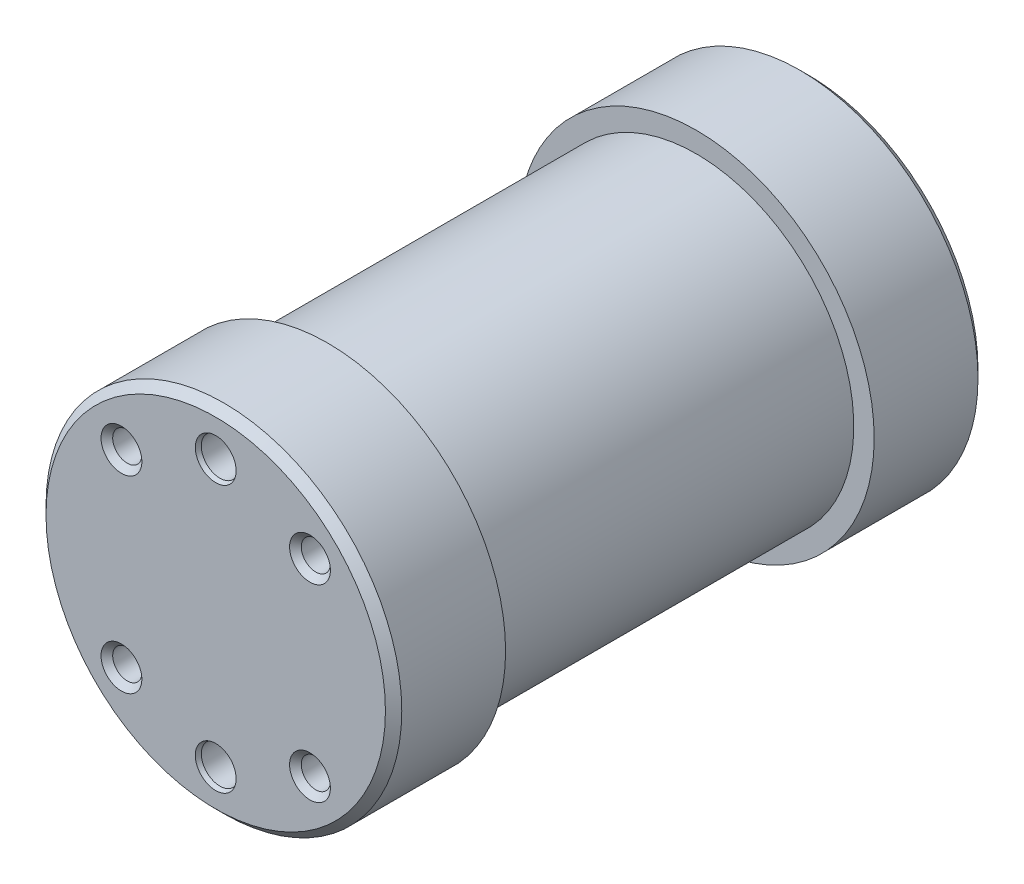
from build123d import *

# Parameters (mm, degrees)
CHAMFER1_SIZE     = 0.7
CIRPATTERN1_COUNT = 4


with BuildPart() as part:
    # Sketch2 → Revolve1 (revolve)
    with BuildSketch(Plane(origin=(0, 0, 0), x_dir=(1, 0, 0), z_dir=(0, 1, 0)), mode=Mode.PRIVATE) as revolve1_sk:
        Polygon((0, 25.4), (0, -25.4), (15.25, -25.4), (15.25, -15.8), (13.5, -15.8), (13.5, 15.8), (15.25, 15.8), (15.25, 25.4), align=None)
    revolve(revolve1_sk.sketch.rotate(Axis((0, 0, -25.4), (0, 0, 1)), 180), axis=Axis((0, 0, -25.4), (0, 0, 1)))

    # Chamfer1
    chamfer1_edges = [part.edges().sort_by_distance(p)[0] for p in [
        (15.25, 0, -25.4),
        (15.25, 0, 25.4),
    ]]
    chamfer(chamfer1_edges, length=CHAMFER1_SIZE)

    # Sketch3 → M3x0.5 Tapped Hole1 (revolve, cut)
    with BuildSketch(Plane(origin=(-8.082230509, -8.082230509, 25.4), x_dir=(0, -1, 0), z_dir=(1, 0, 0))):
        Polygon((0, 0), (0, 8.751075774), (1.25, 8), (1.25, 0.5), (1.75, 0), align=None)
    m3x0_5_tapped_hole1 = revolve(axis=Axis((-8.082230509, -8.082230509, 31.75), (0, 0, -1)), mode=Mode.SUBTRACT)

    # CirPattern1: M3x0.5 Tapped Hole1 ×4 about axis
    cirpattern1_axis = Axis((0, 0, 0), (0, 0, 1))
    for i in range(1, CIRPATTERN1_COUNT):
        add(m3x0_5_tapped_hole1.rotate(cirpattern1_axis, i * 360 / CIRPATTERN1_COUNT), mode=Mode.SUBTRACT)

    # Sketch5 → M3 Clearance Hole1 (revolve, cut)
    with BuildSketch(Plane(origin=(0, 11.43, 25.4), x_dir=(0, -1, 0), z_dir=(1, 0, 0))):
        Polygon((0, 0), (0, 8.96137699), (1.6, 8), (1.6, 0.362132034), (1.75, 0), align=None)
    m3_clearance_hole1 = revolve(axis=Axis((0, 11.43, 31.75), (0, 0, -1)), mode=Mode.SUBTRACT)

    # Mirror1: M3 Clearance Hole1 across plane
    add(m3_clearance_hole1.mirror(Plane.ZX), mode=Mode.SUBTRACT)

    # Mirror2: M3x0.5 Tapped Hole1, M3 Clearance Hole1 across plane
    add(m3x0_5_tapped_hole1.mirror(Plane.XY), mode=Mode.SUBTRACT)
    add(m3_clearance_hole1.mirror(Plane.XY), mode=Mode.SUBTRACT)

    # Mirror2 copy 1 sketch → Mirror2 copy 1 (revolve, cut)
    with BuildSketch(Plane(origin=(8.082230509, -8.082230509, -25.4), x_dir=(1, 0, 0), z_dir=(0, 1, 0))):
        Polygon((0, 0), (0, -8.751075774), (1.25, -8), (1.25, -0.5), (1.75, 0), align=None)
    revolve(axis=Axis((8.082230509, -8.082230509, -31.75), (0, 0, -1)), mode=Mode.SUBTRACT)

    # Mirror2 copy 2 sketch → Mirror2 copy 2 (revolve, cut)
    with BuildSketch(Plane(origin=(8.082230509, 8.082230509, -25.4), x_dir=(0, 1, 0), z_dir=(-1, 0, 0))):
        Polygon((0, 0), (0, -8.751075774), (1.25, -8), (1.25, -0.5), (1.75, 0), align=None)
    revolve(axis=Axis((8.082230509, 8.082230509, -31.75), (0, 0, -1)), mode=Mode.SUBTRACT)

    # Mirror2 copy 3 sketch → Mirror2 copy 3 (revolve, cut)
    with BuildSketch(Plane(origin=(-8.082230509, 8.082230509, -25.4), x_dir=(-1, 0, 0), z_dir=(0, -1, 0))):
        Polygon((0, 0), (0, -8.751075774), (1.25, -8), (1.25, -0.5), (1.75, 0), align=None)
    revolve(axis=Axis((-8.082230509, 8.082230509, -31.75), (0, 0, -1)), mode=Mode.SUBTRACT)

    # Mirror2 copy 4 sketch → Mirror2 copy 4 (revolve, cut)
    with BuildSketch(Plane(origin=(0, -11.43, -25.4), x_dir=(0, 1, 0), z_dir=(1, 0, 0))):
        Polygon((0, 0), (0, 8.96137699), (1.6, 8), (1.6, 0.362132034), (1.75, 0), align=None)
    revolve(axis=Axis((0, -11.43, -31.75), (0, 0, 1)), mode=Mode.SUBTRACT)


solid = part.part
